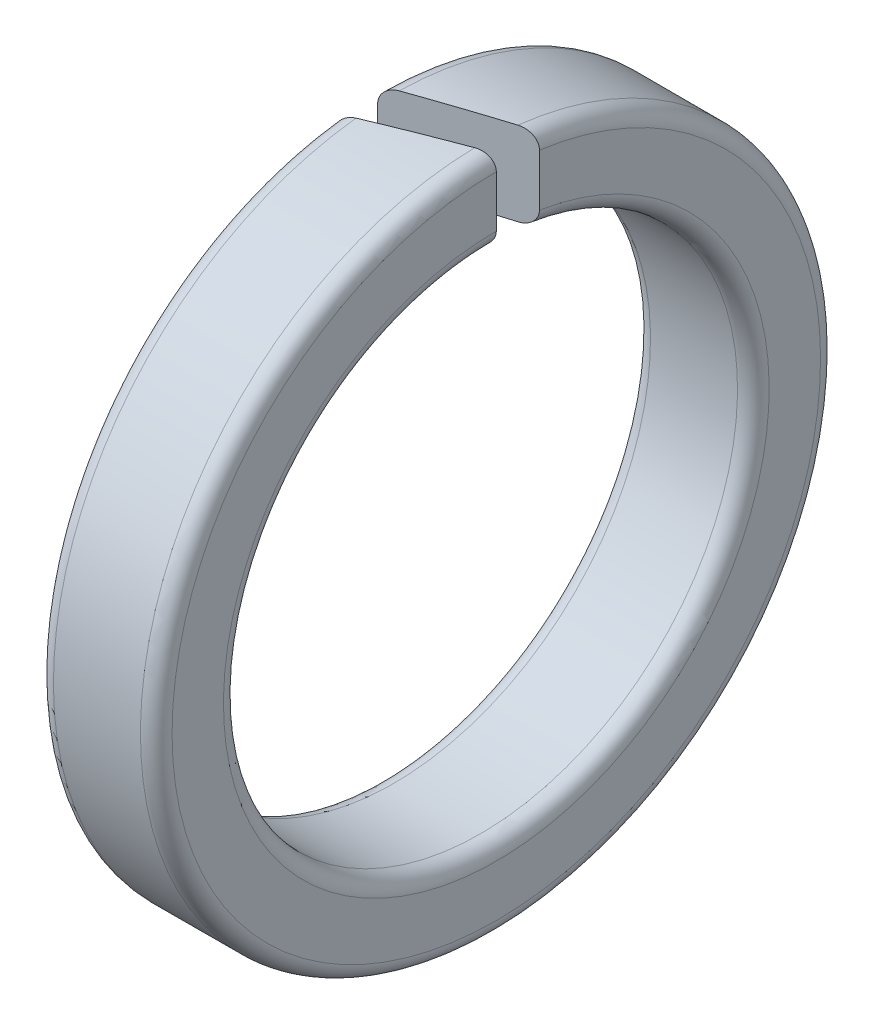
ISO-10303-21;
HEADER;
FILE_DESCRIPTION(('STEP AP214'),'2;1');
FILE_NAME('part.step','',(''),(''),'','','');
FILE_SCHEMA(('AUTOMOTIVE_DESIGN { 1 0 10303 214 1 1 1 1 }'));
ENDSEC;
DATA;
#1=APPLICATION_CONTEXT('core data for automotive mechanical design processes');
#2=APPLICATION_PROTOCOL_DEFINITION('international standard','automotive_design',2000,#1);
#3=PRODUCT_CONTEXT('',#1,'mechanical');
#4=PRODUCT('Part','Part','',(#3));
#5=PRODUCT_RELATED_PRODUCT_CATEGORY('part','',(#4));
#6=PRODUCT_DEFINITION_FORMATION('','',#4);
#7=PRODUCT_DEFINITION_CONTEXT('part definition',#1,'design');
#8=PRODUCT_DEFINITION('design','',#6,#7);
#9=PRODUCT_DEFINITION_SHAPE('','',#8);
#10=(LENGTH_UNIT() NAMED_UNIT(*) SI_UNIT(.MILLI.,.METRE.));
#11=(NAMED_UNIT(*) PLANE_ANGLE_UNIT() SI_UNIT($,.RADIAN.));
#12=(NAMED_UNIT(*) SI_UNIT($,.STERADIAN.) SOLID_ANGLE_UNIT());
#13=UNCERTAINTY_MEASURE_WITH_UNIT(LENGTH_MEASURE(1.E-05),#10,'distance_accuracy_value','');
#14=(GEOMETRIC_REPRESENTATION_CONTEXT(3) GLOBAL_UNCERTAINTY_ASSIGNED_CONTEXT((#13)) GLOBAL_UNIT_ASSIGNED_CONTEXT((#10,
#11,#12)) REPRESENTATION_CONTEXT('',''));
#15=CARTESIAN_POINT('',(0.,0.,0.));
#16=DIRECTION('',(0.,0.,1.));
#17=DIRECTION('',(1.,0.,0.));
#18=AXIS2_PLACEMENT_3D('',#15,#16,#17);
#19=CARTESIAN_POINT('',(0.,0.,-4.3));
#20=DIRECTION('',(1.,0.,0.));
#21=DIRECTION('',(0.,0.,-1.));
#22=AXIS2_PLACEMENT_3D('',#19,#20,#21);
#23=PLANE('',#22);
#24=DIRECTION('',(0.,-1.,0.));
#25=VECTOR('',#24,1.);
#26=CARTESIAN_POINT('',(0.,4.3,0.));
#27=LINE('',#26,#25);
#28=CARTESIAN_POINT('',(0.,4.1,0.));
#29=VERTEX_POINT('',#28);
#30=CARTESIAN_POINT('',(0.,3.45,0.));
#31=VERTEX_POINT('',#30);
#32=EDGE_CURVE('E206',#29,#31,#27,.T.);
#33=ORIENTED_EDGE('',*,*,#32,.F.);
#34=CARTESIAN_POINT('',(0.,0.,0.));
#35=DIRECTION('',(1.,0.,0.));
#36=DIRECTION('',(0.,0.,-1.));
#37=AXIS2_PLACEMENT_3D('',#34,#35,#36);
#38=CIRCLE('',#37,4.1);
#39=CARTESIAN_POINT('',(0.,4.06348775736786,0.545955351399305));
#40=VERTEX_POINT('',#39);
#41=EDGE_CURVE('E208',#29,#40,#38,.F.);
#42=ORIENTED_EDGE('',*,*,#41,.T.);
#43=DIRECTION('',(0.,-1.,0.));
#44=VECTOR('',#43,1.);
#45=CARTESIAN_POINT('',(0.,4.3,0.545955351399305));
#46=LINE('',#45,#44);
#47=CARTESIAN_POINT('',(0.,3.40652796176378,0.545955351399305));
#48=VERTEX_POINT('',#47);
#49=EDGE_CURVE('E104',#40,#48,#46,.T.);
#50=ORIENTED_EDGE('',*,*,#49,.T.);
#51=CARTESIAN_POINT('',(0.,0.,0.));
#52=DIRECTION('',(1.,0.,0.));
#53=DIRECTION('',(0.,0.,-1.));
#54=AXIS2_PLACEMENT_3D('',#51,#52,#53);
#55=CIRCLE('',#54,3.45);
#56=EDGE_CURVE('E49',#48,#31,#55,.T.);
#57=ORIENTED_EDGE('',*,*,#56,.T.);
#58=EDGE_LOOP('',(#33,#42,#50,#57));
#59=FACE_BOUND('',#58,.T.);
#60=ADVANCED_FACE('F35',(#59),#23,.F.);
#61=CARTESIAN_POINT('',(0.,0.,0.));
#62=DIRECTION('',(-1.,0.,0.));
#63=DIRECTION('',(0.,0.,1.));
#64=AXIS2_PLACEMENT_3D('',#61,#62,#63);
#65=CYLINDRICAL_SURFACE('',#64,3.25);
#66=CARTESIAN_POINT('',(1.5,0.,0.));
#67=DIRECTION('',(-0.342020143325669,0.,-0.939692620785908));
#68=DIRECTION('',(-0.939692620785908,0.,0.342020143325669));
#69=AXIS2_PLACEMENT_3D('',#66,#67,#68);
#70=ELLIPSE('',#69,9.50236430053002,3.25);
#71=CARTESIAN_POINT('',(1.3,3.24918467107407,0.0727940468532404));
#72=VERTEX_POINT('',#71);
#73=CARTESIAN_POINT('',(0.199999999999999,3.21537219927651,0.473161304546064));
#74=VERTEX_POINT('',#73);
#75=EDGE_CURVE('E217',#72,#74,#70,.F.);
#76=ORIENTED_EDGE('',*,*,#75,.F.);
#77=CARTESIAN_POINT('',(1.3,0.,0.));
#78=DIRECTION('',(-1.,0.,0.));
#79=DIRECTION('',(0.,0.,1.));
#80=AXIS2_PLACEMENT_3D('',#77,#78,#79);
#81=CIRCLE('',#80,3.25);
#82=CARTESIAN_POINT('',(1.30000000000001,3.21537219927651,-0.473161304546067));
#83=VERTEX_POINT('',#82);
#84=EDGE_CURVE('E11',#72,#83,#81,.F.);
#85=ORIENTED_EDGE('',*,*,#84,.T.);
#86=CARTESIAN_POINT('',(0.,0.,0.));
#87=DIRECTION('',(0.34202014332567,0.,0.939692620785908));
#88=DIRECTION('',(-0.939692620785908,0.,0.34202014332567));
#89=AXIS2_PLACEMENT_3D('',#86,#87,#88);
#90=ELLIPSE('',#89,9.50236430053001,3.25);
#91=CARTESIAN_POINT('',(0.200000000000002,3.24918467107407,-0.0727940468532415));
#92=VERTEX_POINT('',#91);
#93=EDGE_CURVE('E219',#92,#83,#90,.F.);
#94=ORIENTED_EDGE('',*,*,#93,.F.);
#95=CARTESIAN_POINT('',(0.2,0.,0.));
#96=DIRECTION('',(1.,0.,0.));
#97=DIRECTION('',(0.,0.,-1.));
#98=AXIS2_PLACEMENT_3D('',#95,#96,#97);
#99=CIRCLE('',#98,3.25);
#100=EDGE_CURVE('E42',#92,#74,#99,.F.);
#101=ORIENTED_EDGE('',*,*,#100,.T.);
#102=EDGE_LOOP('',(#76,#85,#94,#101));
#103=FACE_BOUND('',#102,.T.);
#104=ADVANCED_FACE('F216',(#103),#65,.F.);
#105=CARTESIAN_POINT('',(1.5,0.,-4.3));
#106=DIRECTION('',(-1.,0.,0.));
#107=DIRECTION('',(0.,0.,1.));
#108=AXIS2_PLACEMENT_3D('',#105,#106,#107);
#109=PLANE('',#108);
#110=DIRECTION('',(0.,-1.,0.));
#111=VECTOR('',#110,1.);
#112=CARTESIAN_POINT('',(1.5,4.3,0.));
#113=LINE('',#112,#111);
#114=CARTESIAN_POINT('',(1.5,4.1,0.));
#115=VERTEX_POINT('',#114);
#116=CARTESIAN_POINT('',(1.5,3.45,0.));
#117=VERTEX_POINT('',#116);
#118=EDGE_CURVE('E201',#115,#117,#113,.T.);
#119=ORIENTED_EDGE('',*,*,#118,.F.);
#120=CARTESIAN_POINT('',(1.5,0.,0.));
#121=DIRECTION('',(-1.,0.,0.));
#122=DIRECTION('',(0.,0.,1.));
#123=AXIS2_PLACEMENT_3D('',#120,#121,#122);
#124=CIRCLE('',#123,4.1);
#125=CARTESIAN_POINT('',(1.5,4.06348775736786,-0.545955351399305));
#126=VERTEX_POINT('',#125);
#127=EDGE_CURVE('E156',#115,#126,#124,.F.);
#128=ORIENTED_EDGE('',*,*,#127,.T.);
#129=DIRECTION('',(0.,-1.,0.));
#130=VECTOR('',#129,1.);
#131=CARTESIAN_POINT('',(1.5,4.3,-0.545955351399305));
#132=LINE('',#131,#130);
#133=CARTESIAN_POINT('',(1.5,3.40652796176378,-0.545955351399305));
#134=VERTEX_POINT('',#133);
#135=EDGE_CURVE('E200',#126,#134,#132,.T.);
#136=ORIENTED_EDGE('',*,*,#135,.T.);
#137=CARTESIAN_POINT('',(1.5,0.,0.));
#138=DIRECTION('',(-1.,0.,0.));
#139=DIRECTION('',(0.,0.,1.));
#140=AXIS2_PLACEMENT_3D('',#137,#138,#139);
#141=CIRCLE('',#140,3.45);
#142=EDGE_CURVE('E190',#134,#117,#141,.T.);
#143=ORIENTED_EDGE('',*,*,#142,.T.);
#144=EDGE_LOOP('',(#119,#128,#136,#143));
#145=FACE_BOUND('',#144,.T.);
#146=ADVANCED_FACE('F199',(#145),#109,.F.);
#147=CARTESIAN_POINT('',(0.,0.,0.));
#148=DIRECTION('',(-1.,0.,0.));
#149=DIRECTION('',(0.,0.,1.));
#150=AXIS2_PLACEMENT_3D('',#147,#148,#149);
#151=CYLINDRICAL_SURFACE('',#150,4.3);
#152=CARTESIAN_POINT('',(0.,0.,0.));
#153=DIRECTION('',(0.34202014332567,0.,0.939692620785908));
#154=DIRECTION('',(-0.939692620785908,0.,0.34202014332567));
#155=AXIS2_PLACEMENT_3D('',#152,#153,#154);
#156=ELLIPSE('',#155,12.5723589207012,4.3);
#157=CARTESIAN_POINT('',(1.3,4.27388796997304,-0.473161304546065));
#158=VERTEX_POINT('',#157);
#159=CARTESIAN_POINT('',(0.200000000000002,4.29938379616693,-0.0727940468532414));
#160=VERTEX_POINT('',#159);
#161=EDGE_CURVE('E119',#158,#160,#156,.T.);
#162=ORIENTED_EDGE('',*,*,#161,.F.);
#163=CARTESIAN_POINT('',(1.3,0.,0.));
#164=DIRECTION('',(-1.,0.,0.));
#165=DIRECTION('',(0.,0.,1.));
#166=AXIS2_PLACEMENT_3D('',#163,#164,#165);
#167=CIRCLE('',#166,4.3);
#168=CARTESIAN_POINT('',(1.3,4.29938379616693,0.0727940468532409));
#169=VERTEX_POINT('',#168);
#170=EDGE_CURVE('E118',#158,#169,#167,.T.);
#171=ORIENTED_EDGE('',*,*,#170,.T.);
#172=CARTESIAN_POINT('',(1.5,0.,0.));
#173=DIRECTION('',(-0.342020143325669,0.,-0.939692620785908));
#174=DIRECTION('',(-0.939692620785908,0.,0.342020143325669));
#175=AXIS2_PLACEMENT_3D('',#172,#173,#174);
#176=ELLIPSE('',#175,12.5723589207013,4.3);
#177=CARTESIAN_POINT('',(0.200000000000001,4.27388796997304,0.473161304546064));
#178=VERTEX_POINT('',#177);
#179=EDGE_CURVE('E103',#178,#169,#176,.T.);
#180=ORIENTED_EDGE('',*,*,#179,.F.);
#181=CARTESIAN_POINT('',(0.2,0.,0.));
#182=DIRECTION('',(1.,0.,0.));
#183=DIRECTION('',(0.,0.,-1.));
#184=AXIS2_PLACEMENT_3D('',#181,#182,#183);
#185=CIRCLE('',#184,4.3);
#186=EDGE_CURVE('E116',#178,#160,#185,.T.);
#187=ORIENTED_EDGE('',*,*,#186,.T.);
#188=EDGE_LOOP('',(#162,#171,#180,#187));
#189=FACE_BOUND('',#188,.T.);
#190=ADVANCED_FACE('F115',(#189),#151,.T.);
#191=CARTESIAN_POINT('',(0.,4.3,0.));
#192=DIRECTION('',(0.34202014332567,0.,0.939692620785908));
#193=DIRECTION('',(0.939692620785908,0.,-0.34202014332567));
#194=AXIS2_PLACEMENT_3D('',#191,#192,#193);
#195=PLANE('',#194);
#196=ORIENTED_EDGE('',*,*,#135,.F.);
#197=CARTESIAN_POINT('',(1.5,4.06348775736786,-0.545955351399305));
#198=CARTESIAN_POINT('',(1.50000976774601,4.07476654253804,-0.54595890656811));
#199=CARTESIAN_POINT('',(1.49906376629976,4.08603101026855,-0.545614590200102));
#200=CARTESIAN_POINT('',(1.49538894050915,4.1081907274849,-0.544277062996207));
#201=CARTESIAN_POINT('',(1.49266581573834,4.11908704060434,-0.543285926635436));
#202=CARTESIAN_POINT('',(1.48556751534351,4.14023508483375,-0.540702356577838));
#203=CARTESIAN_POINT('',(1.48119400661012,4.15048745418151,-0.539110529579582));
#204=CARTESIAN_POINT('',(1.47096243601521,4.17012016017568,-0.535386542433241));
#205=CARTESIAN_POINT('',(1.46510345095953,4.17949994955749,-0.533254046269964));
#206=CARTESIAN_POINT('',(1.45178421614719,4.19758909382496,-0.52840624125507));
#207=CARTESIAN_POINT('',(1.44426200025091,4.20624673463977,-0.525668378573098));
#208=CARTESIAN_POINT('',(1.42802345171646,4.22218549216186,-0.519758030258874));
#209=CARTESIAN_POINT('',(1.41930671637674,4.22946614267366,-0.51658539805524));
#210=CARTESIAN_POINT('',(1.40039157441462,4.24286616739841,-0.509700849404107));
#211=CARTESIAN_POINT('',(1.39013708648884,4.24889591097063,-0.505968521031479));
#212=CARTESIAN_POINT('',(1.36884478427,4.25909631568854,-0.498218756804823));
#213=CARTESIAN_POINT('',(1.35780732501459,4.26326781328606,-0.494201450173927));
#214=CARTESIAN_POINT('',(1.3389288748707,4.26860342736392,-0.487330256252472));
#215=CARTESIAN_POINT('',(1.33121818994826,4.27030457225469,-0.484523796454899));
#216=CARTESIAN_POINT('',(1.31567844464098,4.27278829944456,-0.478867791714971));
#217=CARTESIAN_POINT('',(1.30784956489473,4.27357216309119,-0.476018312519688));
#218=CARTESIAN_POINT('',(1.30000000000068,4.27388796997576,-0.473161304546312));
#219=B_SPLINE_CURVE_WITH_KNOTS('',3,(#197,#198,#199,#200,#201,#202,#203,#204,#205,#206,#207,
#208,#209,#210,#211,#212,#213,#214,#215,#216,#217,#218),.UNSPECIFIED.,.F.,.F.,(4,2,2,2,2,2,2,2,
2,2,4),(0.,0.0337703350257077,0.0674328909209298,0.101061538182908,0.134711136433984,
0.169931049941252,0.205162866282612,0.242399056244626,0.279618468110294,0.304710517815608,
0.32976747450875),.UNSPECIFIED.);
#220=EDGE_CURVE('E175',#126,#158,#219,.T.);
#221=ORIENTED_EDGE('',*,*,#220,.T.);
#222=ORIENTED_EDGE('',*,*,#161,.T.);
#223=CARTESIAN_POINT('',(0.2,4.29938379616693,-0.0727940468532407));
#224=CARTESIAN_POINT('',(0.188294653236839,4.29946334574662,-0.0685336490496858));
#225=CARTESIAN_POINT('',(0.176581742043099,4.29849426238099,-0.0642704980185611));
#226=CARTESIAN_POINT('',(0.153456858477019,4.29450038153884,-0.0558537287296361));
#227=CARTESIAN_POINT('',(0.142045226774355,4.29147335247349,-0.051700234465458));
#228=CARTESIAN_POINT('',(0.119853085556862,4.28340051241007,-0.0436229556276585));
#229=CARTESIAN_POINT('',(0.109073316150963,4.27835238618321,-0.0396994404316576));
#230=CARTESIAN_POINT('',(0.0885042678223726,4.26634525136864,-0.0322129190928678));
#231=CARTESIAN_POINT('',(0.0787142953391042,4.25938759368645,-0.0286496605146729));
#232=CARTESIAN_POINT('',(0.0607388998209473,4.24396627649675,-0.0221071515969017));
#233=CARTESIAN_POINT('',(0.0525131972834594,4.23555588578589,-0.0191132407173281));
#234=CARTESIAN_POINT('',(0.0376000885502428,4.21730383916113,-0.0136853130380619));
#235=CARTESIAN_POINT('',(0.0309127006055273,4.20746216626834,-0.0112513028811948));
#236=CARTESIAN_POINT('',(0.0196752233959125,4.18722674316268,-0.00716119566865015));
#237=CARTESIAN_POINT('',(0.0150260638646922,4.1768951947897,-0.00546903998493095));
#238=CARTESIAN_POINT('',(0.00752956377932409,4.15552336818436,-0.00274053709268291));
#239=CARTESIAN_POINT('',(0.00467961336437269,4.14448414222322,-0.00170323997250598));
#240=CARTESIAN_POINT('',(0.00186018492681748,4.12778136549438,-0.000677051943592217));
#241=CARTESIAN_POINT('',(0.00116293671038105,4.12224721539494,-0.000423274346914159));
#242=CARTESIAN_POINT('',(0.000233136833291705,4.11114303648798,-8.4854867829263E-05));
#243=CARTESIAN_POINT('',(-9.14007586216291E-08,4.10557307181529,3.32671555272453E-08));
#244=CARTESIAN_POINT('',(0.,4.10000000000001,0.));
#245=B_SPLINE_CURVE_WITH_KNOTS('',3,(#223,#224,#225,#226,#227,#228,#229,#230,#231,#232,#233,
#234,#235,#236,#237,#238,#239,#240,#241,#242,#243,#244),.UNSPECIFIED.,.F.,.F.,(4,2,2,2,2,2,2,2,
2,2,4),(0.,0.0373306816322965,0.0747019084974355,0.11211606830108,0.149503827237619,
0.185734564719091,0.22196573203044,0.25615872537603,0.290302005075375,0.307033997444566,
0.323741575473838),.UNSPECIFIED.);
#246=EDGE_CURVE('E56',#160,#29,#245,.T.);
#247=ORIENTED_EDGE('',*,*,#246,.T.);
#248=ORIENTED_EDGE('',*,*,#32,.T.);
#249=CARTESIAN_POINT('',(0.,3.45,0.));
#250=CARTESIAN_POINT('',(-1.16935617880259E-05,3.43922946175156,4.25610842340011E-06));
#251=CARTESIAN_POINT('',(0.000869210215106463,3.42846587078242,-0.000316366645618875));
#252=CARTESIAN_POINT('',(0.00432548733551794,3.40727828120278,-0.00157434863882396));
#253=CARTESIAN_POINT('',(0.00689656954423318,3.39685349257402,-0.00251014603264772));
#254=CARTESIAN_POINT('',(0.0136428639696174,3.37661302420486,-0.0049655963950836));
#255=CARTESIAN_POINT('',(0.0178178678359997,3.36679726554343,-0.00648517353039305));
#256=CARTESIAN_POINT('',(0.0276178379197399,3.34802254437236,-0.0100520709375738));
#257=CARTESIAN_POINT('',(0.0332432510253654,3.33906384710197,-0.0120995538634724));
#258=CARTESIAN_POINT('',(0.0459240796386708,3.32198792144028,-0.0167149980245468));
#259=CARTESIAN_POINT('',(0.0530134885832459,3.31389934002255,-0.0192953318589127));
#260=CARTESIAN_POINT('',(0.0683014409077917,3.29901312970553,-0.0248596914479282));
#261=CARTESIAN_POINT('',(0.0765003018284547,3.29221587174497,-0.0278438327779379));
#262=CARTESIAN_POINT('',(0.0943122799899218,3.27965847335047,-0.0343268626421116));
#263=CARTESIAN_POINT('',(0.103981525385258,3.27398857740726,-0.0378461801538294));
#264=CARTESIAN_POINT('',(0.124040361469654,3.26434273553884,-0.0451469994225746));
#265=CARTESIAN_POINT('',(0.134430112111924,3.26036716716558,-0.0489285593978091));
#266=CARTESIAN_POINT('',(0.153993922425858,3.25465985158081,-0.056049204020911));
#267=CARTESIAN_POINT('',(0.163103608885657,3.25267423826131,-0.0593648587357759));
#268=CARTESIAN_POINT('',(0.181473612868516,3.24997464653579,-0.0660509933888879));
#269=CARTESIAN_POINT('',(0.1907336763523,3.24925871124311,-0.069421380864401));
#270=CARTESIAN_POINT('',(0.2,3.24918467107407,-0.0727940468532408));
#271=B_SPLINE_CURVE_WITH_KNOTS('',3,(#249,#250,#251,#252,#253,#254,#255,#256,#257,#258,#259,
#260,#261,#262,#263,#264,#265,#266,#267,#268,#269,#270),.UNSPECIFIED.,.F.,.F.,(4,2,2,2,2,2,2,2,
2,2,4),(0.,0.0322601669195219,0.0644387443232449,0.0966131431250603,0.128797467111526,
0.161836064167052,0.194884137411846,0.229977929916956,0.265079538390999,0.294684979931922,
0.32424475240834),.UNSPECIFIED.);
#272=EDGE_CURVE('E149',#31,#92,#271,.T.);
#273=ORIENTED_EDGE('',*,*,#272,.T.);
#274=ORIENTED_EDGE('',*,*,#93,.T.);
#275=CARTESIAN_POINT('',(1.3,3.21537219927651,-0.473161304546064));
#276=CARTESIAN_POINT('',(1.31136908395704,3.21475581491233,-0.4772993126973));
#277=CARTESIAN_POINT('',(1.32279471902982,3.21512308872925,-0.481457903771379));
#278=CARTESIAN_POINT('',(1.34546547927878,3.21785010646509,-0.489709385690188));
#279=CARTESIAN_POINT('',(1.35670999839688,3.22021551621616,-0.493802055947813));
#280=CARTESIAN_POINT('',(1.37868179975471,3.22697550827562,-0.501799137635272));
#281=CARTESIAN_POINT('',(1.38940782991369,3.2313747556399,-0.505703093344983));
#282=CARTESIAN_POINT('',(1.40993436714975,3.24214531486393,-0.513174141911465));
#283=CARTESIAN_POINT('',(1.41973617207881,3.24851380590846,-0.516741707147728));
#284=CARTESIAN_POINT('',(1.43750161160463,3.262644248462,-0.523207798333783));
#285=CARTESIAN_POINT('',(1.44554044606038,3.27029902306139,-0.526133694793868));
#286=CARTESIAN_POINT('',(1.46019000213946,3.28702904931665,-0.531465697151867));
#287=CARTESIAN_POINT('',(1.46680094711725,3.2961040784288,-0.533871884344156));
#288=CARTESIAN_POINT('',(1.47796514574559,3.31475202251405,-0.537935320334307));
#289=CARTESIAN_POINT('',(1.48262525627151,3.32425276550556,-0.539631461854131));
#290=CARTESIAN_POINT('',(1.49034007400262,3.34396486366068,-0.542439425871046));
#291=CARTESIAN_POINT('',(1.49339553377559,3.3541758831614,-0.543551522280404));
#292=CARTESIAN_POINT('',(1.49707718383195,3.37146380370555,-0.544891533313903));
#293=CARTESIAN_POINT('',(1.49817559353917,3.37843146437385,-0.545291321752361));
#294=CARTESIAN_POINT('',(1.49963699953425,3.39244150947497,-0.545823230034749));
#295=CARTESIAN_POINT('',(1.50000126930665,3.3994837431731,-0.545955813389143));
#296=CARTESIAN_POINT('',(1.50000000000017,3.40652796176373,-0.545955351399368));
#297=B_SPLINE_CURVE_WITH_KNOTS('',3,(#275,#276,#277,#278,#279,#280,#281,#282,#283,#284,#285,
#286,#287,#288,#289,#290,#291,#292,#293,#294,#295,#296),.UNSPECIFIED.,.F.,.F.,(4,2,2,2,2,2,2,2,
2,2,4),(0.,0.0363203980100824,0.0727441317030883,0.109251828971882,0.145707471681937,
0.179964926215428,0.214217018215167,0.246212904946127,0.278193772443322,0.299347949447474,
0.320465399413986),.UNSPECIFIED.);
#298=EDGE_CURVE('E155',#83,#134,#297,.T.);
#299=ORIENTED_EDGE('',*,*,#298,.T.);
#300=EDGE_LOOP('',(#196,#221,#222,#247,#248,#273,#274,#299));
#301=FACE_BOUND('',#300,.T.);
#302=ADVANCED_FACE('F162',(#301),#195,.T.);
#303=CARTESIAN_POINT('',(1.5,4.3,0.));
#304=DIRECTION('',(-0.342020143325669,0.,-0.939692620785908));
#305=DIRECTION('',(-0.939692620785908,0.,0.342020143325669));
#306=AXIS2_PLACEMENT_3D('',#303,#304,#305);
#307=PLANE('',#306);
#308=ORIENTED_EDGE('',*,*,#179,.T.);
#309=CARTESIAN_POINT('',(1.3,4.29938379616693,0.0727940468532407));
#310=CARTESIAN_POINT('',(1.31170534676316,4.29946334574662,0.0685336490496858));
#311=CARTESIAN_POINT('',(1.3234182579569,4.29849426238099,0.0642704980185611));
#312=CARTESIAN_POINT('',(1.34654314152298,4.29450038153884,0.0558537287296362));
#313=CARTESIAN_POINT('',(1.35795477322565,4.29147335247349,0.051700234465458));
#314=CARTESIAN_POINT('',(1.38014691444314,4.28340051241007,0.0436229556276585));
#315=CARTESIAN_POINT('',(1.39092668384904,4.27835238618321,0.0396994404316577));
#316=CARTESIAN_POINT('',(1.41149573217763,4.26634525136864,0.0322129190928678));
#317=CARTESIAN_POINT('',(1.4212857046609,4.25938759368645,0.0286496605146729));
#318=CARTESIAN_POINT('',(1.43926110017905,4.24396627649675,0.0221071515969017));
#319=CARTESIAN_POINT('',(1.44748680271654,4.23555588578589,0.0191132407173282));
#320=CARTESIAN_POINT('',(1.46239991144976,4.21730383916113,0.0136853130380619));
#321=CARTESIAN_POINT('',(1.46908729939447,4.20746216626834,0.0112513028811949));
#322=CARTESIAN_POINT('',(1.48032477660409,4.18722674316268,0.00716119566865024));
#323=CARTESIAN_POINT('',(1.48497393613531,4.1768951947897,0.00546903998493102));
#324=CARTESIAN_POINT('',(1.49247043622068,4.15552336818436,0.002740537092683));
#325=CARTESIAN_POINT('',(1.49532038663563,4.14448414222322,0.00170323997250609));
#326=CARTESIAN_POINT('',(1.49813981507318,4.12778136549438,0.000677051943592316));
#327=CARTESIAN_POINT('',(1.49883706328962,4.12224721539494,0.000423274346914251));
#328=CARTESIAN_POINT('',(1.49976686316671,4.11114303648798,8.48548678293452E-05));
#329=CARTESIAN_POINT('',(1.50000009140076,4.10557307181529,-3.32671554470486E-08));
#330=CARTESIAN_POINT('',(1.50000000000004,4.10000000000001,0.));
#331=B_SPLINE_CURVE_WITH_KNOTS('',3,(#309,#310,#311,#312,#313,#314,#315,#316,#317,#318,#319,
#320,#321,#322,#323,#324,#325,#326,#327,#328,#329,#330),.UNSPECIFIED.,.F.,.F.,(4,2,2,2,2,2,2,2,
2,2,4),(0.,0.0373306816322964,0.0747019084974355,0.11211606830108,0.149503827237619,
0.185734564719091,0.22196573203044,0.25615872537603,0.290302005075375,0.307033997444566,
0.323741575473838),.UNSPECIFIED.);
#332=EDGE_CURVE('E109',#169,#115,#331,.T.);
#333=ORIENTED_EDGE('',*,*,#332,.T.);
#334=ORIENTED_EDGE('',*,*,#118,.T.);
#335=CARTESIAN_POINT('',(1.5,3.45,0.));
#336=CARTESIAN_POINT('',(1.50001169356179,3.43922946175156,-4.25610842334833E-06));
#337=CARTESIAN_POINT('',(1.49913078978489,3.42846587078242,0.00031636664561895));
#338=CARTESIAN_POINT('',(1.49567451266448,3.40727828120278,0.00157434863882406));
#339=CARTESIAN_POINT('',(1.49310343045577,3.39685349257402,0.00251014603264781));
#340=CARTESIAN_POINT('',(1.48635713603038,3.37661302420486,0.00496559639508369));
#341=CARTESIAN_POINT('',(1.482182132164,3.36679726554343,0.00648517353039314));
#342=CARTESIAN_POINT('',(1.47238216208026,3.34802254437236,0.0100520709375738));
#343=CARTESIAN_POINT('',(1.46675674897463,3.33906384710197,0.0120995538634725));
#344=CARTESIAN_POINT('',(1.45407592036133,3.32198792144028,0.0167149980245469));
#345=CARTESIAN_POINT('',(1.44698651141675,3.31389934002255,0.0192953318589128));
#346=CARTESIAN_POINT('',(1.43169855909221,3.29901312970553,0.0248596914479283));
#347=CARTESIAN_POINT('',(1.42349969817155,3.29221587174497,0.027843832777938));
#348=CARTESIAN_POINT('',(1.40568772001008,3.27965847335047,0.0343268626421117));
#349=CARTESIAN_POINT('',(1.39601847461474,3.27398857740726,0.0378461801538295));
#350=CARTESIAN_POINT('',(1.37595963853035,3.26434273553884,0.0451469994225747));
#351=CARTESIAN_POINT('',(1.36556988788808,3.26036716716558,0.0489285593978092));
#352=CARTESIAN_POINT('',(1.34600607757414,3.25465985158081,0.0560492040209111));
#353=CARTESIAN_POINT('',(1.33689639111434,3.25267423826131,0.0593648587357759));
#354=CARTESIAN_POINT('',(1.31852638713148,3.24997464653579,0.0660509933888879));
#355=CARTESIAN_POINT('',(1.3092663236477,3.24925871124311,0.069421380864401));
#356=CARTESIAN_POINT('',(1.3,3.24918467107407,0.0727940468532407));
#357=B_SPLINE_CURVE_WITH_KNOTS('',3,(#335,#336,#337,#338,#339,#340,#341,#342,#343,#344,#345,
#346,#347,#348,#349,#350,#351,#352,#353,#354,#355,#356),.UNSPECIFIED.,.F.,.F.,(4,2,2,2,2,2,2,2,
2,2,4),(0.,0.0322601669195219,0.0644387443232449,0.0966131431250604,0.128797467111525,
0.161836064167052,0.194884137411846,0.229977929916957,0.265079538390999,0.294684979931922,
0.32424475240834),.UNSPECIFIED.);
#358=EDGE_CURVE('E110',#117,#72,#357,.T.);
#359=ORIENTED_EDGE('',*,*,#358,.T.);
#360=ORIENTED_EDGE('',*,*,#75,.T.);
#361=CARTESIAN_POINT('',(0.2,3.21537219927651,0.473161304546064));
#362=CARTESIAN_POINT('',(0.188630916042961,3.21475581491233,0.4772993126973));
#363=CARTESIAN_POINT('',(0.177205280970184,3.21512308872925,0.481457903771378));
#364=CARTESIAN_POINT('',(0.154534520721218,3.21785010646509,0.489709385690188));
#365=CARTESIAN_POINT('',(0.143290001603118,3.22021551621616,0.493802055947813));
#366=CARTESIAN_POINT('',(0.121318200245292,3.22697550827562,0.501799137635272));
#367=CARTESIAN_POINT('',(0.11059217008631,3.2313747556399,0.505703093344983));
#368=CARTESIAN_POINT('',(0.0900656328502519,3.24214531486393,0.513174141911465));
#369=CARTESIAN_POINT('',(0.0802638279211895,3.24851380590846,0.516741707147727));
#370=CARTESIAN_POINT('',(0.0624983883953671,3.262644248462,0.523207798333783));
#371=CARTESIAN_POINT('',(0.0544595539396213,3.27029902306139,0.526133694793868));
#372=CARTESIAN_POINT('',(0.0398099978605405,3.28702904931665,0.531465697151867));
#373=CARTESIAN_POINT('',(0.0331990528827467,3.2961040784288,0.533871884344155));
#374=CARTESIAN_POINT('',(0.0220348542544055,3.31475202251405,0.537935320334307));
#375=CARTESIAN_POINT('',(0.0173747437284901,3.32425276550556,0.539631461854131));
#376=CARTESIAN_POINT('',(0.00965992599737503,3.34396486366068,0.542439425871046));
#377=CARTESIAN_POINT('',(0.00660446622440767,3.3541758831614,0.543551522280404));
#378=CARTESIAN_POINT('',(0.00292281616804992,3.37146380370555,0.544891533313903));
#379=CARTESIAN_POINT('',(0.00182440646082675,3.37843146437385,0.545291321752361));
#380=CARTESIAN_POINT('',(0.000363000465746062,3.39244150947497,0.545823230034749));
#381=CARTESIAN_POINT('',(-1.26930664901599E-06,3.3994837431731,0.545955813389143));
#382=CARTESIAN_POINT('',(-1.7171803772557E-13,3.40652796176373,0.545955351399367));
#383=B_SPLINE_CURVE_WITH_KNOTS('',3,(#361,#362,#363,#364,#365,#366,#367,#368,#369,#370,#371,
#372,#373,#374,#375,#376,#377,#378,#379,#380,#381,#382),.UNSPECIFIED.,.F.,.F.,(4,2,2,2,2,2,2,2,
2,2,4),(0.,0.0363203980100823,0.0727441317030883,0.109251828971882,0.145707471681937,
0.179964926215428,0.214217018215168,0.246212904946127,0.278193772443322,0.299347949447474,
0.320465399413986),.UNSPECIFIED.);
#384=EDGE_CURVE('E123',#74,#48,#383,.T.);
#385=ORIENTED_EDGE('',*,*,#384,.T.);
#386=ORIENTED_EDGE('',*,*,#49,.F.);
#387=CARTESIAN_POINT('',(0.,4.06348775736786,0.545955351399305));
#388=CARTESIAN_POINT('',(-9.76774601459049E-06,4.07476654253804,0.54595890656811));
#389=CARTESIAN_POINT('',(0.000936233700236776,4.08603101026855,0.545614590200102));
#390=CARTESIAN_POINT('',(0.00461105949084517,4.1081907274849,0.544277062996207));
#391=CARTESIAN_POINT('',(0.00733418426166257,4.11908704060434,0.543285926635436));
#392=CARTESIAN_POINT('',(0.0144324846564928,4.14023508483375,0.540702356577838));
#393=CARTESIAN_POINT('',(0.0188059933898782,4.15048745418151,0.539110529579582));
#394=CARTESIAN_POINT('',(0.0290375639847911,4.17012016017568,0.535386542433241));
#395=CARTESIAN_POINT('',(0.0348965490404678,4.17949994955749,0.533254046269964));
#396=CARTESIAN_POINT('',(0.0482157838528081,4.19758909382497,0.52840624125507));
#397=CARTESIAN_POINT('',(0.0557379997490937,4.20624673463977,0.525668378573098));
#398=CARTESIAN_POINT('',(0.0719765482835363,4.22218549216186,0.519758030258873));
#399=CARTESIAN_POINT('',(0.0806932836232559,4.22946614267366,0.516585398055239));
#400=CARTESIAN_POINT('',(0.0996084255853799,4.24286616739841,0.509700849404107));
#401=CARTESIAN_POINT('',(0.109862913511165,4.24889591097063,0.505968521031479));
#402=CARTESIAN_POINT('',(0.131155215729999,4.25909631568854,0.498218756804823));
#403=CARTESIAN_POINT('',(0.142192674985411,4.26326781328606,0.494201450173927));
#404=CARTESIAN_POINT('',(0.161071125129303,4.26860342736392,0.487330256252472));
#405=CARTESIAN_POINT('',(0.168781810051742,4.27030457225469,0.484523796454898));
#406=CARTESIAN_POINT('',(0.18432155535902,4.27278829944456,0.478867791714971));
#407=CARTESIAN_POINT('',(0.192150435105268,4.27357216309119,0.476018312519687));
#408=CARTESIAN_POINT('',(0.199999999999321,4.27388796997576,0.473161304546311));
#409=B_SPLINE_CURVE_WITH_KNOTS('',3,(#387,#388,#389,#390,#391,#392,#393,#394,#395,#396,#397,
#398,#399,#400,#401,#402,#403,#404,#405,#406,#407,#408),.UNSPECIFIED.,.F.,.F.,(4,2,2,2,2,2,2,2,
2,2,4),(0.,0.0337703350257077,0.0674328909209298,0.101061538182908,0.134711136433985,
0.169931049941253,0.205162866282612,0.242399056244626,0.279618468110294,0.304710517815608,
0.32976747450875),.UNSPECIFIED.);
#410=EDGE_CURVE('E100',#40,#178,#409,.T.);
#411=ORIENTED_EDGE('',*,*,#410,.T.);
#412=EDGE_LOOP('',(#308,#333,#334,#359,#360,#385,#386,#411));
#413=FACE_BOUND('',#412,.T.);
#414=ADVANCED_FACE('F102',(#413),#307,.T.);
#415=CARTESIAN_POINT('',(1.3,0.,0.));
#416=DIRECTION('',(-1.,0.,0.));
#417=DIRECTION('',(0.,0.,1.));
#418=AXIS2_PLACEMENT_3D('',#415,#416,#417);
#419=TOROIDAL_SURFACE('',#418,4.1,0.2);
#420=ORIENTED_EDGE('',*,*,#220,.F.);
#421=ORIENTED_EDGE('',*,*,#127,.F.);
#422=ORIENTED_EDGE('',*,*,#332,.F.);
#423=ORIENTED_EDGE('',*,*,#170,.F.);
#424=EDGE_LOOP('',(#420,#421,#422,#423));
#425=FACE_BOUND('',#424,.T.);
#426=ADVANCED_FACE('F166',(#425),#419,.T.);
#427=CARTESIAN_POINT('',(0.2,0.,0.));
#428=DIRECTION('',(1.,0.,0.));
#429=DIRECTION('',(0.,0.,-1.));
#430=AXIS2_PLACEMENT_3D('',#427,#428,#429);
#431=TOROIDAL_SURFACE('',#430,4.1,0.2);
#432=ORIENTED_EDGE('',*,*,#246,.F.);
#433=ORIENTED_EDGE('',*,*,#186,.F.);
#434=ORIENTED_EDGE('',*,*,#410,.F.);
#435=ORIENTED_EDGE('',*,*,#41,.F.);
#436=EDGE_LOOP('',(#432,#433,#434,#435));
#437=FACE_BOUND('',#436,.T.);
#438=ADVANCED_FACE('F121',(#437),#431,.T.);
#439=CARTESIAN_POINT('',(1.3,0.,0.));
#440=DIRECTION('',(-1.,0.,0.));
#441=DIRECTION('',(0.,0.,1.));
#442=AXIS2_PLACEMENT_3D('',#439,#440,#441);
#443=TOROIDAL_SURFACE('',#442,3.45,0.2);
#444=ORIENTED_EDGE('',*,*,#298,.F.);
#445=ORIENTED_EDGE('',*,*,#84,.F.);
#446=ORIENTED_EDGE('',*,*,#358,.F.);
#447=ORIENTED_EDGE('',*,*,#142,.F.);
#448=EDGE_LOOP('',(#444,#445,#446,#447));
#449=FACE_BOUND('',#448,.T.);
#450=ADVANCED_FACE('F143',(#449),#443,.T.);
#451=CARTESIAN_POINT('',(0.2,0.,0.));
#452=DIRECTION('',(1.,0.,0.));
#453=DIRECTION('',(0.,0.,-1.));
#454=AXIS2_PLACEMENT_3D('',#451,#452,#453);
#455=TOROIDAL_SURFACE('',#454,3.45,0.2);
#456=ORIENTED_EDGE('',*,*,#272,.F.);
#457=ORIENTED_EDGE('',*,*,#56,.F.);
#458=ORIENTED_EDGE('',*,*,#384,.F.);
#459=ORIENTED_EDGE('',*,*,#100,.F.);
#460=EDGE_LOOP('',(#456,#457,#458,#459));
#461=FACE_BOUND('',#460,.T.);
#462=ADVANCED_FACE('F140',(#461),#455,.T.);
#463=CLOSED_SHELL('',(#60,#104,#146,#190,#302,#414,#426,#438,#450,#462));
#464=MANIFOLD_SOLID_BREP('B2',#463);
#465=ADVANCED_BREP_SHAPE_REPRESENTATION('',(#18,#464),#14);
#466=SHAPE_DEFINITION_REPRESENTATION(#9,#465);
ENDSEC;
END-ISO-10303-21;
